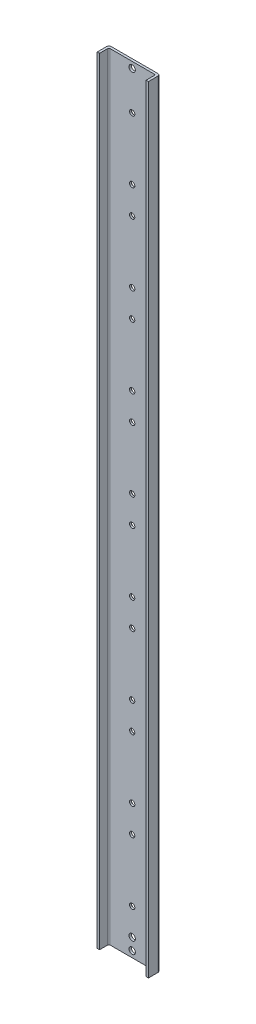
ISO-10303-21;
HEADER;
FILE_DESCRIPTION(('STEP AP214'),'2;1');
FILE_NAME('part.step','',(''),(''),'','','');
FILE_SCHEMA(('AUTOMOTIVE_DESIGN { 1 0 10303 214 1 1 1 1 }'));
ENDSEC;
DATA;
#1=APPLICATION_CONTEXT('core data for automotive mechanical design processes');
#2=APPLICATION_PROTOCOL_DEFINITION('international standard','automotive_design',2000,#1);
#3=PRODUCT_CONTEXT('',#1,'mechanical');
#4=PRODUCT('Part','Part','',(#3));
#5=PRODUCT_RELATED_PRODUCT_CATEGORY('part','',(#4));
#6=PRODUCT_DEFINITION_FORMATION('','',#4);
#7=PRODUCT_DEFINITION_CONTEXT('part definition',#1,'design');
#8=PRODUCT_DEFINITION('design','',#6,#7);
#9=PRODUCT_DEFINITION_SHAPE('','',#8);
#10=(LENGTH_UNIT() NAMED_UNIT(*) SI_UNIT(.MILLI.,.METRE.));
#11=(NAMED_UNIT(*) PLANE_ANGLE_UNIT() SI_UNIT($,.RADIAN.));
#12=(NAMED_UNIT(*) SI_UNIT($,.STERADIAN.) SOLID_ANGLE_UNIT());
#13=UNCERTAINTY_MEASURE_WITH_UNIT(LENGTH_MEASURE(1.E-05),#10,'distance_accuracy_value','');
#14=(GEOMETRIC_REPRESENTATION_CONTEXT(3) GLOBAL_UNCERTAINTY_ASSIGNED_CONTEXT((#13)) GLOBAL_UNIT_ASSIGNED_CONTEXT((#10,
#11,#12)) REPRESENTATION_CONTEXT('',''));
#15=CARTESIAN_POINT('',(0.,0.,0.));
#16=DIRECTION('',(0.,0.,1.));
#17=DIRECTION('',(1.,0.,0.));
#18=AXIS2_PLACEMENT_3D('',#15,#16,#17);
#19=CARTESIAN_POINT('',(-33.,500.,-7.5));
#20=DIRECTION('',(0.,0.,1.));
#21=DIRECTION('',(1.,0.,0.));
#22=AXIS2_PLACEMENT_3D('',#19,#20,#21);
#23=PLANE('',#22);
#24=CARTESIAN_POINT('',(0.,492.,-7.5));
#25=DIRECTION('',(0.,0.,-1.));
#26=DIRECTION('',(-1.,0.,0.));
#27=AXIS2_PLACEMENT_3D('',#24,#25,#26);
#28=CIRCLE('',#27,4.09999999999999);
#29=CARTESIAN_POINT('',(-4.09999999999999,492.,-7.5));
#30=VERTEX_POINT('',#29);
#31=EDGE_CURVE('E1046',#30,#30,#28,.T.);
#32=ORIENTED_EDGE('',*,*,#31,.F.);
#33=EDGE_LOOP('',(#32));
#34=FACE_BOUND('',#33,.T.);
#35=CARTESIAN_POINT('',(0.,-492.,-7.5));
#36=DIRECTION('',(0.,0.,-1.));
#37=DIRECTION('',(-1.,0.,0.));
#38=AXIS2_PLACEMENT_3D('',#35,#36,#37);
#39=CIRCLE('',#38,4.09999999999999);
#40=CARTESIAN_POINT('',(-4.09999999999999,-492.,-7.5));
#41=VERTEX_POINT('',#40);
#42=EDGE_CURVE('E215',#41,#41,#39,.T.);
#43=ORIENTED_EDGE('',*,*,#42,.F.);
#44=EDGE_LOOP('',(#43));
#45=FACE_BOUND('',#44,.T.);
#46=CARTESIAN_POINT('',(0.,-477.,-7.5));
#47=DIRECTION('',(0.,0.,-1.));
#48=DIRECTION('',(-1.,0.,0.));
#49=AXIS2_PLACEMENT_3D('',#46,#47,#48);
#50=CIRCLE('',#49,4.09999999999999);
#51=CARTESIAN_POINT('',(-4.09999999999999,-477.,-7.5));
#52=VERTEX_POINT('',#51);
#53=EDGE_CURVE('E229',#52,#52,#50,.T.);
#54=ORIENTED_EDGE('',*,*,#53,.F.);
#55=EDGE_LOOP('',(#54));
#56=FACE_BOUND('',#55,.T.);
#57=DIRECTION('',(-1.,0.,0.));
#58=VECTOR('',#57,1.);
#59=CARTESIAN_POINT('',(-33.,-500.,-7.5));
#60=LINE('',#59,#58);
#61=CARTESIAN_POINT('',(30.,-500.,-7.5));
#62=VERTEX_POINT('',#61);
#63=CARTESIAN_POINT('',(-30.,-500.,-7.5));
#64=VERTEX_POINT('',#63);
#65=EDGE_CURVE('E166',#62,#64,#60,.T.);
#66=ORIENTED_EDGE('',*,*,#65,.T.);
#67=DIRECTION('',(0.,-1.,0.));
#68=VECTOR('',#67,1.);
#69=CARTESIAN_POINT('',(-30.,500.,-7.5));
#70=LINE('',#69,#68);
#71=CARTESIAN_POINT('',(-30.,500.,-7.5));
#72=VERTEX_POINT('',#71);
#73=EDGE_CURVE('E190',#64,#72,#70,.F.);
#74=ORIENTED_EDGE('',*,*,#73,.T.);
#75=DIRECTION('',(-1.,0.,0.));
#76=VECTOR('',#75,1.);
#77=CARTESIAN_POINT('',(-33.,500.,-7.5));
#78=LINE('',#77,#76);
#79=CARTESIAN_POINT('',(30.,500.,-7.5));
#80=VERTEX_POINT('',#79);
#81=EDGE_CURVE('E159',#80,#72,#78,.T.);
#82=ORIENTED_EDGE('',*,*,#81,.F.);
#83=DIRECTION('',(0.,-1.,0.));
#84=VECTOR('',#83,1.);
#85=CARTESIAN_POINT('',(30.,500.,-7.5));
#86=LINE('',#85,#84);
#87=EDGE_CURVE('E187',#80,#62,#86,.T.);
#88=ORIENTED_EDGE('',*,*,#87,.T.);
#89=EDGE_LOOP('',(#66,#74,#82,#88));
#90=FACE_BOUND('',#89,.T.);
#91=CARTESIAN_POINT('',(0.,-442.5,-7.5));
#92=DIRECTION('',(0.,0.,-1.));
#93=DIRECTION('',(-1.,0.,0.));
#94=AXIS2_PLACEMENT_3D('',#91,#92,#93);
#95=CIRCLE('',#94,4.025);
#96=CARTESIAN_POINT('',(-4.025,-442.5,-7.5));
#97=VERTEX_POINT('',#96);
#98=EDGE_CURVE('E360',#97,#97,#95,.T.);
#99=ORIENTED_EDGE('',*,*,#98,.F.);
#100=EDGE_LOOP('',(#99));
#101=FACE_BOUND('',#100,.T.);
#102=CARTESIAN_POINT('',(0.,-362.5,-7.5));
#103=DIRECTION('',(0.,0.,-1.));
#104=DIRECTION('',(-1.,0.,0.));
#105=AXIS2_PLACEMENT_3D('',#102,#103,#104);
#106=CIRCLE('',#105,4.025);
#107=CARTESIAN_POINT('',(-4.025,-362.5,-7.5));
#108=VERTEX_POINT('',#107);
#109=EDGE_CURVE('E351',#108,#108,#106,.T.);
#110=ORIENTED_EDGE('',*,*,#109,.F.);
#111=EDGE_LOOP('',(#110));
#112=FACE_BOUND('',#111,.T.);
#113=CARTESIAN_POINT('',(0.,-327.5,-7.5));
#114=DIRECTION('',(0.,0.,-1.));
#115=DIRECTION('',(-1.,0.,0.));
#116=AXIS2_PLACEMENT_3D('',#113,#114,#115);
#117=CIRCLE('',#116,4.025);
#118=CARTESIAN_POINT('',(-4.025,-327.5,-7.5));
#119=VERTEX_POINT('',#118);
#120=EDGE_CURVE('E342',#119,#119,#117,.T.);
#121=ORIENTED_EDGE('',*,*,#120,.F.);
#122=EDGE_LOOP('',(#121));
#123=FACE_BOUND('',#122,.T.);
#124=CARTESIAN_POINT('',(0.,-247.5,-7.5));
#125=DIRECTION('',(0.,0.,-1.));
#126=DIRECTION('',(-1.,0.,0.));
#127=AXIS2_PLACEMENT_3D('',#124,#125,#126);
#128=CIRCLE('',#127,4.025);
#129=CARTESIAN_POINT('',(-4.025,-247.5,-7.5));
#130=VERTEX_POINT('',#129);
#131=EDGE_CURVE('E333',#130,#130,#128,.T.);
#132=ORIENTED_EDGE('',*,*,#131,.F.);
#133=EDGE_LOOP('',(#132));
#134=FACE_BOUND('',#133,.T.);
#135=CARTESIAN_POINT('',(0.,-212.5,-7.5));
#136=DIRECTION('',(0.,0.,-1.));
#137=DIRECTION('',(-1.,0.,0.));
#138=AXIS2_PLACEMENT_3D('',#135,#136,#137);
#139=CIRCLE('',#138,4.025);
#140=CARTESIAN_POINT('',(-4.025,-212.5,-7.5));
#141=VERTEX_POINT('',#140);
#142=EDGE_CURVE('E324',#141,#141,#139,.T.);
#143=ORIENTED_EDGE('',*,*,#142,.F.);
#144=EDGE_LOOP('',(#143));
#145=FACE_BOUND('',#144,.T.);
#146=CARTESIAN_POINT('',(0.,-132.5,-7.5));
#147=DIRECTION('',(0.,0.,-1.));
#148=DIRECTION('',(-1.,0.,0.));
#149=AXIS2_PLACEMENT_3D('',#146,#147,#148);
#150=CIRCLE('',#149,4.025);
#151=CARTESIAN_POINT('',(-4.025,-132.5,-7.5));
#152=VERTEX_POINT('',#151);
#153=EDGE_CURVE('E315',#152,#152,#150,.T.);
#154=ORIENTED_EDGE('',*,*,#153,.F.);
#155=EDGE_LOOP('',(#154));
#156=FACE_BOUND('',#155,.T.);
#157=CARTESIAN_POINT('',(0.,-97.5,-7.5));
#158=DIRECTION('',(0.,0.,-1.));
#159=DIRECTION('',(-1.,0.,0.));
#160=AXIS2_PLACEMENT_3D('',#157,#158,#159);
#161=CIRCLE('',#160,4.025);
#162=CARTESIAN_POINT('',(-4.025,-97.5,-7.5));
#163=VERTEX_POINT('',#162);
#164=EDGE_CURVE('E306',#163,#163,#161,.T.);
#165=ORIENTED_EDGE('',*,*,#164,.F.);
#166=EDGE_LOOP('',(#165));
#167=FACE_BOUND('',#166,.T.);
#168=CARTESIAN_POINT('',(0.,-17.5,-7.5));
#169=DIRECTION('',(0.,0.,-1.));
#170=DIRECTION('',(-1.,0.,0.));
#171=AXIS2_PLACEMENT_3D('',#168,#169,#170);
#172=CIRCLE('',#171,4.025);
#173=CARTESIAN_POINT('',(-4.025,-17.5,-7.5));
#174=VERTEX_POINT('',#173);
#175=EDGE_CURVE('E297',#174,#174,#172,.T.);
#176=ORIENTED_EDGE('',*,*,#175,.F.);
#177=EDGE_LOOP('',(#176));
#178=FACE_BOUND('',#177,.T.);
#179=CARTESIAN_POINT('',(0.,17.5,-7.5));
#180=DIRECTION('',(0.,0.,-1.));
#181=DIRECTION('',(-1.,0.,0.));
#182=AXIS2_PLACEMENT_3D('',#179,#180,#181);
#183=CIRCLE('',#182,4.025);
#184=CARTESIAN_POINT('',(-4.025,17.5,-7.5));
#185=VERTEX_POINT('',#184);
#186=EDGE_CURVE('E288',#185,#185,#183,.T.);
#187=ORIENTED_EDGE('',*,*,#186,.F.);
#188=EDGE_LOOP('',(#187));
#189=FACE_BOUND('',#188,.T.);
#190=CARTESIAN_POINT('',(0.,97.5,-7.5));
#191=DIRECTION('',(0.,0.,-1.));
#192=DIRECTION('',(-1.,0.,0.));
#193=AXIS2_PLACEMENT_3D('',#190,#191,#192);
#194=CIRCLE('',#193,4.025);
#195=CARTESIAN_POINT('',(-4.025,97.5,-7.5));
#196=VERTEX_POINT('',#195);
#197=EDGE_CURVE('E279',#196,#196,#194,.T.);
#198=ORIENTED_EDGE('',*,*,#197,.F.);
#199=EDGE_LOOP('',(#198));
#200=FACE_BOUND('',#199,.T.);
#201=CARTESIAN_POINT('',(0.,132.5,-7.5));
#202=DIRECTION('',(0.,0.,-1.));
#203=DIRECTION('',(-1.,0.,0.));
#204=AXIS2_PLACEMENT_3D('',#201,#202,#203);
#205=CIRCLE('',#204,4.025);
#206=CARTESIAN_POINT('',(-4.025,132.5,-7.5));
#207=VERTEX_POINT('',#206);
#208=EDGE_CURVE('E270',#207,#207,#205,.T.);
#209=ORIENTED_EDGE('',*,*,#208,.F.);
#210=EDGE_LOOP('',(#209));
#211=FACE_BOUND('',#210,.T.);
#212=CARTESIAN_POINT('',(0.,212.5,-7.5));
#213=DIRECTION('',(0.,0.,-1.));
#214=DIRECTION('',(-1.,0.,0.));
#215=AXIS2_PLACEMENT_3D('',#212,#213,#214);
#216=CIRCLE('',#215,4.025);
#217=CARTESIAN_POINT('',(-4.025,212.5,-7.5));
#218=VERTEX_POINT('',#217);
#219=EDGE_CURVE('E261',#218,#218,#216,.T.);
#220=ORIENTED_EDGE('',*,*,#219,.F.);
#221=EDGE_LOOP('',(#220));
#222=FACE_BOUND('',#221,.T.);
#223=CARTESIAN_POINT('',(0.,247.5,-7.5));
#224=DIRECTION('',(0.,0.,-1.));
#225=DIRECTION('',(-1.,0.,0.));
#226=AXIS2_PLACEMENT_3D('',#223,#224,#225);
#227=CIRCLE('',#226,4.025);
#228=CARTESIAN_POINT('',(-4.025,247.5,-7.5));
#229=VERTEX_POINT('',#228);
#230=EDGE_CURVE('E252',#229,#229,#227,.T.);
#231=ORIENTED_EDGE('',*,*,#230,.F.);
#232=EDGE_LOOP('',(#231));
#233=FACE_BOUND('',#232,.T.);
#234=CARTESIAN_POINT('',(0.,327.5,-7.5));
#235=DIRECTION('',(0.,0.,-1.));
#236=DIRECTION('',(-1.,0.,0.));
#237=AXIS2_PLACEMENT_3D('',#234,#235,#236);
#238=CIRCLE('',#237,4.025);
#239=CARTESIAN_POINT('',(-4.025,327.5,-7.5));
#240=VERTEX_POINT('',#239);
#241=EDGE_CURVE('E243',#240,#240,#238,.T.);
#242=ORIENTED_EDGE('',*,*,#241,.F.);
#243=EDGE_LOOP('',(#242));
#244=FACE_BOUND('',#243,.T.);
#245=CARTESIAN_POINT('',(0.,362.5,-7.5));
#246=DIRECTION('',(0.,0.,-1.));
#247=DIRECTION('',(-1.,0.,0.));
#248=AXIS2_PLACEMENT_3D('',#245,#246,#247);
#249=CIRCLE('',#248,4.025);
#250=CARTESIAN_POINT('',(-4.025,362.5,-7.5));
#251=VERTEX_POINT('',#250);
#252=EDGE_CURVE('E234',#251,#251,#249,.T.);
#253=ORIENTED_EDGE('',*,*,#252,.F.);
#254=EDGE_LOOP('',(#253));
#255=FACE_BOUND('',#254,.T.);
#256=CARTESIAN_POINT('',(0.,442.5,-7.5));
#257=DIRECTION('',(0.,0.,-1.));
#258=DIRECTION('',(-1.,0.,0.));
#259=AXIS2_PLACEMENT_3D('',#256,#257,#258);
#260=CIRCLE('',#259,4.025);
#261=CARTESIAN_POINT('',(-4.025,442.5,-7.5));
#262=VERTEX_POINT('',#261);
#263=EDGE_CURVE('E217',#262,#262,#260,.T.);
#264=ORIENTED_EDGE('',*,*,#263,.F.);
#265=EDGE_LOOP('',(#264));
#266=FACE_BOUND('',#265,.T.);
#267=ADVANCED_FACE('F44',(#34,#45,#56,#90,#101,#112,#123,#134,#145,#156,#167,#178,#189,#200,
#211,#222,#233,#244,#255,#266),#23,.F.);
#268=CARTESIAN_POINT('',(-33.,500.,7.5));
#269=DIRECTION('',(0.,0.,-1.));
#270=DIRECTION('',(-1.,0.,0.));
#271=AXIS2_PLACEMENT_3D('',#268,#269,#270);
#272=PLANE('',#271);
#273=DIRECTION('',(1.,0.,0.));
#274=VECTOR('',#273,1.);
#275=CARTESIAN_POINT('',(-33.,-500.,7.5));
#276=LINE('',#275,#274);
#277=CARTESIAN_POINT('',(-33.,-500.,7.5));
#278=VERTEX_POINT('',#277);
#279=CARTESIAN_POINT('',(-30.,-500.,7.5));
#280=VERTEX_POINT('',#279);
#281=EDGE_CURVE('E172',#278,#280,#276,.T.);
#282=ORIENTED_EDGE('',*,*,#281,.T.);
#283=DIRECTION('',(0.,-1.,0.));
#284=VECTOR('',#283,1.);
#285=CARTESIAN_POINT('',(-30.,500.,7.5));
#286=LINE('',#285,#284);
#287=CARTESIAN_POINT('',(-30.,500.,7.5));
#288=VERTEX_POINT('',#287);
#289=EDGE_CURVE('E149',#288,#280,#286,.T.);
#290=ORIENTED_EDGE('',*,*,#289,.F.);
#291=DIRECTION('',(1.,0.,0.));
#292=VECTOR('',#291,1.);
#293=CARTESIAN_POINT('',(-33.,500.,7.5));
#294=LINE('',#293,#292);
#295=CARTESIAN_POINT('',(-33.,500.,7.5));
#296=VERTEX_POINT('',#295);
#297=EDGE_CURVE('E155',#296,#288,#294,.T.);
#298=ORIENTED_EDGE('',*,*,#297,.F.);
#299=DIRECTION('',(0.,-1.,0.));
#300=VECTOR('',#299,1.);
#301=CARTESIAN_POINT('',(-33.,500.,7.5));
#302=LINE('',#301,#300);
#303=EDGE_CURVE('E177',#296,#278,#302,.T.);
#304=ORIENTED_EDGE('',*,*,#303,.T.);
#305=EDGE_LOOP('',(#282,#290,#298,#304));
#306=FACE_BOUND('',#305,.T.);
#307=ADVANCED_FACE('F402',(#306),#272,.F.);
#308=CARTESIAN_POINT('',(33.,500.,7.5));
#309=DIRECTION('',(-1.,0.,0.));
#310=DIRECTION('',(0.,0.,1.));
#311=AXIS2_PLACEMENT_3D('',#308,#309,#310);
#312=PLANE('',#311);
#313=DIRECTION('',(0.,0.,-1.));
#314=VECTOR('',#313,1.);
#315=CARTESIAN_POINT('',(33.,-500.,7.5));
#316=LINE('',#315,#314);
#317=CARTESIAN_POINT('',(33.,-500.,7.5));
#318=VERTEX_POINT('',#317);
#319=CARTESIAN_POINT('',(33.,-500.,-4.5));
#320=VERTEX_POINT('',#319);
#321=EDGE_CURVE('E163',#318,#320,#316,.T.);
#322=ORIENTED_EDGE('',*,*,#321,.T.);
#323=DIRECTION('',(0.,-1.,0.));
#324=VECTOR('',#323,1.);
#325=CARTESIAN_POINT('',(33.,500.,-4.5));
#326=LINE('',#325,#324);
#327=CARTESIAN_POINT('',(33.,500.,-4.5));
#328=VERTEX_POINT('',#327);
#329=EDGE_CURVE('E196',#320,#328,#326,.F.);
#330=ORIENTED_EDGE('',*,*,#329,.T.);
#331=DIRECTION('',(0.,0.,-1.));
#332=VECTOR('',#331,1.);
#333=CARTESIAN_POINT('',(33.,500.,7.5));
#334=LINE('',#333,#332);
#335=CARTESIAN_POINT('',(33.,500.,7.5));
#336=VERTEX_POINT('',#335);
#337=EDGE_CURVE('E175',#336,#328,#334,.T.);
#338=ORIENTED_EDGE('',*,*,#337,.F.);
#339=DIRECTION('',(0.,-1.,0.));
#340=VECTOR('',#339,1.);
#341=CARTESIAN_POINT('',(33.,500.,7.5));
#342=LINE('',#341,#340);
#343=EDGE_CURVE('E153',#336,#318,#342,.T.);
#344=ORIENTED_EDGE('',*,*,#343,.T.);
#345=EDGE_LOOP('',(#322,#330,#338,#344));
#346=FACE_BOUND('',#345,.T.);
#347=ADVANCED_FACE('F416',(#346),#312,.F.);
#348=CARTESIAN_POINT('',(-33.,500.,7.5));
#349=DIRECTION('',(1.,0.,0.));
#350=DIRECTION('',(0.,0.,-1.));
#351=AXIS2_PLACEMENT_3D('',#348,#349,#350);
#352=PLANE('',#351);
#353=DIRECTION('',(0.,0.,1.));
#354=VECTOR('',#353,1.);
#355=CARTESIAN_POINT('',(-33.,500.,7.5));
#356=LINE('',#355,#354);
#357=CARTESIAN_POINT('',(-33.,500.,-4.5));
#358=VERTEX_POINT('',#357);
#359=EDGE_CURVE('E156',#358,#296,#356,.T.);
#360=ORIENTED_EDGE('',*,*,#359,.F.);
#361=DIRECTION('',(0.,-1.,0.));
#362=VECTOR('',#361,1.);
#363=CARTESIAN_POINT('',(-33.,500.,-4.5));
#364=LINE('',#363,#362);
#365=CARTESIAN_POINT('',(-33.,-500.,-4.5));
#366=VERTEX_POINT('',#365);
#367=EDGE_CURVE('E180',#358,#366,#364,.T.);
#368=ORIENTED_EDGE('',*,*,#367,.T.);
#369=DIRECTION('',(0.,0.,1.));
#370=VECTOR('',#369,1.);
#371=CARTESIAN_POINT('',(-33.,-500.,7.5));
#372=LINE('',#371,#370);
#373=EDGE_CURVE('E169',#366,#278,#372,.T.);
#374=ORIENTED_EDGE('',*,*,#373,.T.);
#375=ORIENTED_EDGE('',*,*,#303,.F.);
#376=EDGE_LOOP('',(#360,#368,#374,#375));
#377=FACE_BOUND('',#376,.T.);
#378=ADVANCED_FACE('F393',(#377),#352,.F.);
#379=CARTESIAN_POINT('',(30.,500.,7.5));
#380=VERTEX_POINT('',#379);
#381=EDGE_CURVE('E137',#380,#336,#294,.T.);
#382=ORIENTED_EDGE('',*,*,#381,.F.);
#383=DIRECTION('',(0.,-1.,0.));
#384=VECTOR('',#383,1.);
#385=CARTESIAN_POINT('',(30.,500.,7.5));
#386=LINE('',#385,#384);
#387=CARTESIAN_POINT('',(30.,-500.,7.5));
#388=VERTEX_POINT('',#387);
#389=EDGE_CURVE('E140',#380,#388,#386,.T.);
#390=ORIENTED_EDGE('',*,*,#389,.T.);
#391=EDGE_CURVE('E171',#388,#318,#276,.T.);
#392=ORIENTED_EDGE('',*,*,#391,.T.);
#393=ORIENTED_EDGE('',*,*,#343,.F.);
#394=EDGE_LOOP('',(#382,#390,#392,#393));
#395=FACE_BOUND('',#394,.T.);
#396=ADVANCED_FACE('F151',(#395),#272,.F.);
#397=CARTESIAN_POINT('',(0.,500.,0.));
#398=DIRECTION('',(0.,-1.,0.));
#399=DIRECTION('',(0.,0.,-1.));
#400=AXIS2_PLACEMENT_3D('',#397,#398,#399);
#401=PLANE('',#400);
#402=ORIENTED_EDGE('',*,*,#81,.T.);
#403=CARTESIAN_POINT('',(-30.,500.,-4.5));
#404=DIRECTION('',(0.,-1.,0.));
#405=DIRECTION('',(0.,0.,-1.));
#406=AXIS2_PLACEMENT_3D('',#403,#404,#405);
#407=CIRCLE('',#406,3.);
#408=EDGE_CURVE('E194',#72,#358,#407,.F.);
#409=ORIENTED_EDGE('',*,*,#408,.T.);
#410=ORIENTED_EDGE('',*,*,#359,.T.);
#411=ORIENTED_EDGE('',*,*,#297,.T.);
#412=DIRECTION('',(0.,0.,-1.));
#413=VECTOR('',#412,1.);
#414=CARTESIAN_POINT('',(-30.,500.,-4.50000000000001));
#415=LINE('',#414,#413);
#416=CARTESIAN_POINT('',(-30.,500.,-3.00000000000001));
#417=VERTEX_POINT('',#416);
#418=EDGE_CURVE('E370',#288,#417,#415,.T.);
#419=ORIENTED_EDGE('',*,*,#418,.T.);
#420=CARTESIAN_POINT('',(-28.5,500.,-3.00000000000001));
#421=DIRECTION('',(0.,-1.,0.));
#422=DIRECTION('',(0.,0.,-1.));
#423=AXIS2_PLACEMENT_3D('',#420,#421,#422);
#424=CIRCLE('',#423,1.5);
#425=CARTESIAN_POINT('',(-28.5,500.,-4.50000000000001));
#426=VERTEX_POINT('',#425);
#427=EDGE_CURVE('E209',#417,#426,#424,.T.);
#428=ORIENTED_EDGE('',*,*,#427,.T.);
#429=DIRECTION('',(1.,0.,0.));
#430=VECTOR('',#429,1.);
#431=CARTESIAN_POINT('',(30.,500.,-4.5));
#432=LINE('',#431,#430);
#433=CARTESIAN_POINT('',(28.5,500.,-4.5));
#434=VERTEX_POINT('',#433);
#435=EDGE_CURVE('E141',#426,#434,#432,.T.);
#436=ORIENTED_EDGE('',*,*,#435,.T.);
#437=CARTESIAN_POINT('',(28.5,500.,-3.));
#438=DIRECTION('',(0.,-1.,0.));
#439=DIRECTION('',(0.,0.,-1.));
#440=AXIS2_PLACEMENT_3D('',#437,#438,#439);
#441=CIRCLE('',#440,1.5);
#442=CARTESIAN_POINT('',(30.,500.,-3.));
#443=VERTEX_POINT('',#442);
#444=EDGE_CURVE('E11',#434,#443,#441,.T.);
#445=ORIENTED_EDGE('',*,*,#444,.T.);
#446=DIRECTION('',(0.,0.,1.));
#447=VECTOR('',#446,1.);
#448=CARTESIAN_POINT('',(30.,500.,7.5));
#449=LINE('',#448,#447);
#450=EDGE_CURVE('E131',#443,#380,#449,.T.);
#451=ORIENTED_EDGE('',*,*,#450,.T.);
#452=ORIENTED_EDGE('',*,*,#381,.T.);
#453=ORIENTED_EDGE('',*,*,#337,.T.);
#454=CARTESIAN_POINT('',(30.,500.,-4.5));
#455=DIRECTION('',(0.,-1.,0.));
#456=DIRECTION('',(0.,0.,-1.));
#457=AXIS2_PLACEMENT_3D('',#454,#455,#456);
#458=CIRCLE('',#457,3.);
#459=EDGE_CURVE('E192',#328,#80,#458,.F.);
#460=ORIENTED_EDGE('',*,*,#459,.T.);
#461=EDGE_LOOP('',(#402,#409,#410,#411,#419,#428,#436,#445,#451,#452,#453,#460));
#462=FACE_BOUND('',#461,.T.);
#463=ADVANCED_FACE('F134',(#462),#401,.F.);
#464=CARTESIAN_POINT('',(0.,-500.,0.));
#465=DIRECTION('',(0.,-1.,0.));
#466=DIRECTION('',(0.,0.,-1.));
#467=AXIS2_PLACEMENT_3D('',#464,#465,#466);
#468=PLANE('',#467);
#469=ORIENTED_EDGE('',*,*,#373,.F.);
#470=CARTESIAN_POINT('',(-30.,-500.,-4.5));
#471=DIRECTION('',(0.,-1.,0.));
#472=DIRECTION('',(0.,0.,-1.));
#473=AXIS2_PLACEMENT_3D('',#470,#471,#472);
#474=CIRCLE('',#473,3.);
#475=EDGE_CURVE('E185',#366,#64,#474,.T.);
#476=ORIENTED_EDGE('',*,*,#475,.T.);
#477=ORIENTED_EDGE('',*,*,#65,.F.);
#478=CARTESIAN_POINT('',(30.,-500.,-4.5));
#479=DIRECTION('',(0.,-1.,0.));
#480=DIRECTION('',(0.,0.,-1.));
#481=AXIS2_PLACEMENT_3D('',#478,#479,#480);
#482=CIRCLE('',#481,3.);
#483=EDGE_CURVE('E183',#62,#320,#482,.T.);
#484=ORIENTED_EDGE('',*,*,#483,.T.);
#485=ORIENTED_EDGE('',*,*,#321,.F.);
#486=ORIENTED_EDGE('',*,*,#391,.F.);
#487=DIRECTION('',(0.,0.,1.));
#488=VECTOR('',#487,1.);
#489=CARTESIAN_POINT('',(30.,-500.,7.5));
#490=LINE('',#489,#488);
#491=CARTESIAN_POINT('',(30.,-500.,-3.));
#492=VERTEX_POINT('',#491);
#493=EDGE_CURVE('E146',#492,#388,#490,.T.);
#494=ORIENTED_EDGE('',*,*,#493,.F.);
#495=CARTESIAN_POINT('',(28.5,-500.,-3.));
#496=DIRECTION('',(0.,-1.,0.));
#497=DIRECTION('',(0.,0.,-1.));
#498=AXIS2_PLACEMENT_3D('',#495,#496,#497);
#499=CIRCLE('',#498,1.5);
#500=CARTESIAN_POINT('',(28.5,-500.,-4.5));
#501=VERTEX_POINT('',#500);
#502=EDGE_CURVE('E53',#492,#501,#499,.F.);
#503=ORIENTED_EDGE('',*,*,#502,.T.);
#504=DIRECTION('',(1.,0.,0.));
#505=VECTOR('',#504,1.);
#506=CARTESIAN_POINT('',(30.,-500.,-4.5));
#507=LINE('',#506,#505);
#508=CARTESIAN_POINT('',(-28.5,-500.,-4.50000000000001));
#509=VERTEX_POINT('',#508);
#510=EDGE_CURVE('E376',#509,#501,#507,.T.);
#511=ORIENTED_EDGE('',*,*,#510,.F.);
#512=CARTESIAN_POINT('',(-28.5,-500.,-3.00000000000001));
#513=DIRECTION('',(0.,-1.,0.));
#514=DIRECTION('',(0.,0.,-1.));
#515=AXIS2_PLACEMENT_3D('',#512,#513,#514);
#516=CIRCLE('',#515,1.5);
#517=CARTESIAN_POINT('',(-30.,-500.,-3.00000000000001));
#518=VERTEX_POINT('',#517);
#519=EDGE_CURVE('E207',#509,#518,#516,.F.);
#520=ORIENTED_EDGE('',*,*,#519,.T.);
#521=DIRECTION('',(0.,0.,-1.));
#522=VECTOR('',#521,1.);
#523=CARTESIAN_POINT('',(-30.,-500.,-4.50000000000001));
#524=LINE('',#523,#522);
#525=EDGE_CURVE('E369',#280,#518,#524,.T.);
#526=ORIENTED_EDGE('',*,*,#525,.F.);
#527=ORIENTED_EDGE('',*,*,#281,.F.);
#528=EDGE_LOOP('',(#469,#476,#477,#484,#485,#486,#494,#503,#511,#520,#526,#527));
#529=FACE_BOUND('',#528,.T.);
#530=ADVANCED_FACE('F397',(#529),#468,.T.);
#531=CARTESIAN_POINT('',(-30.,500.,-4.50000000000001));
#532=DIRECTION('',(-1.,0.,0.));
#533=DIRECTION('',(0.,0.,1.));
#534=AXIS2_PLACEMENT_3D('',#531,#532,#533);
#535=PLANE('',#534);
#536=ORIENTED_EDGE('',*,*,#525,.T.);
#537=DIRECTION('',(0.,-1.,0.));
#538=VECTOR('',#537,1.);
#539=CARTESIAN_POINT('',(-30.,500.,-3.00000000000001));
#540=LINE('',#539,#538);
#541=EDGE_CURVE('E203',#518,#417,#540,.F.);
#542=ORIENTED_EDGE('',*,*,#541,.T.);
#543=ORIENTED_EDGE('',*,*,#418,.F.);
#544=ORIENTED_EDGE('',*,*,#289,.T.);
#545=EDGE_LOOP('',(#536,#542,#543,#544));
#546=FACE_BOUND('',#545,.T.);
#547=ADVANCED_FACE('F587',(#546),#535,.F.);
#548=CARTESIAN_POINT('',(30.,500.,7.5));
#549=DIRECTION('',(1.,0.,0.));
#550=DIRECTION('',(0.,0.,-1.));
#551=AXIS2_PLACEMENT_3D('',#548,#549,#550);
#552=PLANE('',#551);
#553=ORIENTED_EDGE('',*,*,#450,.F.);
#554=DIRECTION('',(0.,-1.,0.));
#555=VECTOR('',#554,1.);
#556=CARTESIAN_POINT('',(30.,-500.,-3.));
#557=LINE('',#556,#555);
#558=EDGE_CURVE('E205',#443,#492,#557,.T.);
#559=ORIENTED_EDGE('',*,*,#558,.T.);
#560=ORIENTED_EDGE('',*,*,#493,.T.);
#561=ORIENTED_EDGE('',*,*,#389,.F.);
#562=EDGE_LOOP('',(#553,#559,#560,#561));
#563=FACE_BOUND('',#562,.T.);
#564=ADVANCED_FACE('F144',(#563),#552,.F.);
#565=CARTESIAN_POINT('',(30.,500.,-4.5));
#566=DIRECTION('',(0.,0.,-1.));
#567=DIRECTION('',(-1.,0.,0.));
#568=AXIS2_PLACEMENT_3D('',#565,#566,#567);
#569=PLANE('',#568);
#570=CARTESIAN_POINT('',(0.,492.,-4.5));
#571=DIRECTION('',(0.,0.,-1.));
#572=DIRECTION('',(-1.,0.,0.));
#573=AXIS2_PLACEMENT_3D('',#570,#571,#572);
#574=CIRCLE('',#573,4.09999999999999);
#575=CARTESIAN_POINT('',(-4.09999999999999,492.,-4.5));
#576=VERTEX_POINT('',#575);
#577=EDGE_CURVE('E48',#576,#576,#574,.T.);
#578=ORIENTED_EDGE('',*,*,#577,.T.);
#579=EDGE_LOOP('',(#578));
#580=FACE_BOUND('',#579,.T.);
#581=CARTESIAN_POINT('',(0.,-492.,-4.5));
#582=DIRECTION('',(0.,0.,-1.));
#583=DIRECTION('',(-1.,0.,0.));
#584=AXIS2_PLACEMENT_3D('',#581,#582,#583);
#585=CIRCLE('',#584,4.09999999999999);
#586=CARTESIAN_POINT('',(-4.09999999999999,-492.,-4.5));
#587=VERTEX_POINT('',#586);
#588=EDGE_CURVE('E214',#587,#587,#585,.T.);
#589=ORIENTED_EDGE('',*,*,#588,.T.);
#590=EDGE_LOOP('',(#589));
#591=FACE_BOUND('',#590,.T.);
#592=CARTESIAN_POINT('',(0.,-477.,-4.5));
#593=DIRECTION('',(0.,0.,-1.));
#594=DIRECTION('',(-1.,0.,0.));
#595=AXIS2_PLACEMENT_3D('',#592,#593,#594);
#596=CIRCLE('',#595,4.09999999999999);
#597=CARTESIAN_POINT('',(-4.09999999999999,-477.,-4.5));
#598=VERTEX_POINT('',#597);
#599=EDGE_CURVE('E212',#598,#598,#596,.T.);
#600=ORIENTED_EDGE('',*,*,#599,.T.);
#601=EDGE_LOOP('',(#600));
#602=FACE_BOUND('',#601,.T.);
#603=CARTESIAN_POINT('',(0.,442.5,-4.5));
#604=DIRECTION('',(0.,0.,-1.));
#605=DIRECTION('',(-1.,0.,0.));
#606=AXIS2_PLACEMENT_3D('',#603,#604,#605);
#607=CIRCLE('',#606,3.4);
#608=CARTESIAN_POINT('',(-3.4,442.5,-4.5));
#609=VERTEX_POINT('',#608);
#610=EDGE_CURVE('E226',#609,#609,#607,.T.);
#611=ORIENTED_EDGE('',*,*,#610,.T.);
#612=EDGE_LOOP('',(#611));
#613=FACE_BOUND('',#612,.T.);
#614=CARTESIAN_POINT('',(0.,362.5,-4.5));
#615=DIRECTION('',(0.,0.,-1.));
#616=DIRECTION('',(-1.,0.,0.));
#617=AXIS2_PLACEMENT_3D('',#614,#615,#616);
#618=CIRCLE('',#617,3.4);
#619=CARTESIAN_POINT('',(-3.4,362.5,-4.5));
#620=VERTEX_POINT('',#619);
#621=EDGE_CURVE('E240',#620,#620,#618,.T.);
#622=ORIENTED_EDGE('',*,*,#621,.T.);
#623=EDGE_LOOP('',(#622));
#624=FACE_BOUND('',#623,.T.);
#625=CARTESIAN_POINT('',(0.,327.5,-4.5));
#626=DIRECTION('',(0.,0.,-1.));
#627=DIRECTION('',(-1.,0.,0.));
#628=AXIS2_PLACEMENT_3D('',#625,#626,#627);
#629=CIRCLE('',#628,3.4);
#630=CARTESIAN_POINT('',(-3.4,327.5,-4.5));
#631=VERTEX_POINT('',#630);
#632=EDGE_CURVE('E249',#631,#631,#629,.T.);
#633=ORIENTED_EDGE('',*,*,#632,.T.);
#634=EDGE_LOOP('',(#633));
#635=FACE_BOUND('',#634,.T.);
#636=CARTESIAN_POINT('',(0.,247.5,-4.5));
#637=DIRECTION('',(0.,0.,-1.));
#638=DIRECTION('',(-1.,0.,0.));
#639=AXIS2_PLACEMENT_3D('',#636,#637,#638);
#640=CIRCLE('',#639,3.4);
#641=CARTESIAN_POINT('',(-3.4,247.5,-4.5));
#642=VERTEX_POINT('',#641);
#643=EDGE_CURVE('E258',#642,#642,#640,.T.);
#644=ORIENTED_EDGE('',*,*,#643,.T.);
#645=EDGE_LOOP('',(#644));
#646=FACE_BOUND('',#645,.T.);
#647=CARTESIAN_POINT('',(0.,212.5,-4.5));
#648=DIRECTION('',(0.,0.,-1.));
#649=DIRECTION('',(-1.,0.,0.));
#650=AXIS2_PLACEMENT_3D('',#647,#648,#649);
#651=CIRCLE('',#650,3.4);
#652=CARTESIAN_POINT('',(-3.4,212.5,-4.5));
#653=VERTEX_POINT('',#652);
#654=EDGE_CURVE('E267',#653,#653,#651,.T.);
#655=ORIENTED_EDGE('',*,*,#654,.T.);
#656=EDGE_LOOP('',(#655));
#657=FACE_BOUND('',#656,.T.);
#658=CARTESIAN_POINT('',(0.,132.5,-4.5));
#659=DIRECTION('',(0.,0.,-1.));
#660=DIRECTION('',(-1.,0.,0.));
#661=AXIS2_PLACEMENT_3D('',#658,#659,#660);
#662=CIRCLE('',#661,3.4);
#663=CARTESIAN_POINT('',(-3.4,132.5,-4.5));
#664=VERTEX_POINT('',#663);
#665=EDGE_CURVE('E276',#664,#664,#662,.T.);
#666=ORIENTED_EDGE('',*,*,#665,.T.);
#667=EDGE_LOOP('',(#666));
#668=FACE_BOUND('',#667,.T.);
#669=CARTESIAN_POINT('',(0.,97.5,-4.5));
#670=DIRECTION('',(0.,0.,-1.));
#671=DIRECTION('',(-1.,0.,0.));
#672=AXIS2_PLACEMENT_3D('',#669,#670,#671);
#673=CIRCLE('',#672,3.4);
#674=CARTESIAN_POINT('',(-3.4,97.5,-4.5));
#675=VERTEX_POINT('',#674);
#676=EDGE_CURVE('E285',#675,#675,#673,.T.);
#677=ORIENTED_EDGE('',*,*,#676,.T.);
#678=EDGE_LOOP('',(#677));
#679=FACE_BOUND('',#678,.T.);
#680=CARTESIAN_POINT('',(0.,17.5,-4.5));
#681=DIRECTION('',(0.,0.,-1.));
#682=DIRECTION('',(-1.,0.,0.));
#683=AXIS2_PLACEMENT_3D('',#680,#681,#682);
#684=CIRCLE('',#683,3.4);
#685=CARTESIAN_POINT('',(-3.4,17.5,-4.5));
#686=VERTEX_POINT('',#685);
#687=EDGE_CURVE('E294',#686,#686,#684,.T.);
#688=ORIENTED_EDGE('',*,*,#687,.T.);
#689=EDGE_LOOP('',(#688));
#690=FACE_BOUND('',#689,.T.);
#691=CARTESIAN_POINT('',(0.,-17.5,-4.5));
#692=DIRECTION('',(0.,0.,-1.));
#693=DIRECTION('',(-1.,0.,0.));
#694=AXIS2_PLACEMENT_3D('',#691,#692,#693);
#695=CIRCLE('',#694,3.4);
#696=CARTESIAN_POINT('',(-3.4,-17.5,-4.5));
#697=VERTEX_POINT('',#696);
#698=EDGE_CURVE('E303',#697,#697,#695,.T.);
#699=ORIENTED_EDGE('',*,*,#698,.T.);
#700=EDGE_LOOP('',(#699));
#701=FACE_BOUND('',#700,.T.);
#702=CARTESIAN_POINT('',(0.,-97.5,-4.5));
#703=DIRECTION('',(0.,0.,-1.));
#704=DIRECTION('',(-1.,0.,0.));
#705=AXIS2_PLACEMENT_3D('',#702,#703,#704);
#706=CIRCLE('',#705,3.4);
#707=CARTESIAN_POINT('',(-3.4,-97.5,-4.5));
#708=VERTEX_POINT('',#707);
#709=EDGE_CURVE('E312',#708,#708,#706,.T.);
#710=ORIENTED_EDGE('',*,*,#709,.T.);
#711=EDGE_LOOP('',(#710));
#712=FACE_BOUND('',#711,.T.);
#713=CARTESIAN_POINT('',(0.,-132.5,-4.5));
#714=DIRECTION('',(0.,0.,-1.));
#715=DIRECTION('',(-1.,0.,0.));
#716=AXIS2_PLACEMENT_3D('',#713,#714,#715);
#717=CIRCLE('',#716,3.4);
#718=CARTESIAN_POINT('',(-3.4,-132.5,-4.5));
#719=VERTEX_POINT('',#718);
#720=EDGE_CURVE('E321',#719,#719,#717,.T.);
#721=ORIENTED_EDGE('',*,*,#720,.T.);
#722=EDGE_LOOP('',(#721));
#723=FACE_BOUND('',#722,.T.);
#724=CARTESIAN_POINT('',(0.,-212.5,-4.5));
#725=DIRECTION('',(0.,0.,-1.));
#726=DIRECTION('',(-1.,0.,0.));
#727=AXIS2_PLACEMENT_3D('',#724,#725,#726);
#728=CIRCLE('',#727,3.4);
#729=CARTESIAN_POINT('',(-3.4,-212.5,-4.5));
#730=VERTEX_POINT('',#729);
#731=EDGE_CURVE('E330',#730,#730,#728,.T.);
#732=ORIENTED_EDGE('',*,*,#731,.T.);
#733=EDGE_LOOP('',(#732));
#734=FACE_BOUND('',#733,.T.);
#735=CARTESIAN_POINT('',(0.,-247.5,-4.5));
#736=DIRECTION('',(0.,0.,-1.));
#737=DIRECTION('',(-1.,0.,0.));
#738=AXIS2_PLACEMENT_3D('',#735,#736,#737);
#739=CIRCLE('',#738,3.4);
#740=CARTESIAN_POINT('',(-3.4,-247.5,-4.5));
#741=VERTEX_POINT('',#740);
#742=EDGE_CURVE('E339',#741,#741,#739,.T.);
#743=ORIENTED_EDGE('',*,*,#742,.T.);
#744=EDGE_LOOP('',(#743));
#745=FACE_BOUND('',#744,.T.);
#746=CARTESIAN_POINT('',(0.,-327.5,-4.5));
#747=DIRECTION('',(0.,0.,-1.));
#748=DIRECTION('',(-1.,0.,0.));
#749=AXIS2_PLACEMENT_3D('',#746,#747,#748);
#750=CIRCLE('',#749,3.4);
#751=CARTESIAN_POINT('',(-3.4,-327.5,-4.5));
#752=VERTEX_POINT('',#751);
#753=EDGE_CURVE('E348',#752,#752,#750,.T.);
#754=ORIENTED_EDGE('',*,*,#753,.T.);
#755=EDGE_LOOP('',(#754));
#756=FACE_BOUND('',#755,.T.);
#757=CARTESIAN_POINT('',(0.,-362.5,-4.5));
#758=DIRECTION('',(0.,0.,-1.));
#759=DIRECTION('',(-1.,0.,0.));
#760=AXIS2_PLACEMENT_3D('',#757,#758,#759);
#761=CIRCLE('',#760,3.4);
#762=CARTESIAN_POINT('',(-3.4,-362.5,-4.5));
#763=VERTEX_POINT('',#762);
#764=EDGE_CURVE('E357',#763,#763,#761,.T.);
#765=ORIENTED_EDGE('',*,*,#764,.T.);
#766=EDGE_LOOP('',(#765));
#767=FACE_BOUND('',#766,.T.);
#768=CARTESIAN_POINT('',(0.,-442.5,-4.5));
#769=DIRECTION('',(0.,0.,-1.));
#770=DIRECTION('',(-1.,0.,0.));
#771=AXIS2_PLACEMENT_3D('',#768,#769,#770);
#772=CIRCLE('',#771,3.4);
#773=CARTESIAN_POINT('',(-3.4,-442.5,-4.5));
#774=VERTEX_POINT('',#773);
#775=EDGE_CURVE('E366',#774,#774,#772,.T.);
#776=ORIENTED_EDGE('',*,*,#775,.T.);
#777=EDGE_LOOP('',(#776));
#778=FACE_BOUND('',#777,.T.);
#779=ORIENTED_EDGE('',*,*,#435,.F.);
#780=DIRECTION('',(0.,-1.,0.));
#781=VECTOR('',#780,1.);
#782=CARTESIAN_POINT('',(-28.5,-500.,-4.50000000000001));
#783=LINE('',#782,#781);
#784=EDGE_CURVE('E200',#426,#509,#783,.T.);
#785=ORIENTED_EDGE('',*,*,#784,.T.);
#786=ORIENTED_EDGE('',*,*,#510,.T.);
#787=DIRECTION('',(0.,-1.,0.));
#788=VECTOR('',#787,1.);
#789=CARTESIAN_POINT('',(28.5,500.,-4.5));
#790=LINE('',#789,#788);
#791=EDGE_CURVE('E198',#501,#434,#790,.F.);
#792=ORIENTED_EDGE('',*,*,#791,.T.);
#793=EDGE_LOOP('',(#779,#785,#786,#792));
#794=FACE_BOUND('',#793,.T.);
#795=ADVANCED_FACE('F413',(#580,#591,#602,#613,#624,#635,#646,#657,#668,#679,#690,#701,#712,
#723,#734,#745,#756,#767,#778,#794),#569,.F.);
#796=CARTESIAN_POINT('',(-30.,500.,-4.5));
#797=DIRECTION('',(0.,-1.,0.));
#798=DIRECTION('',(0.,0.,-1.));
#799=AXIS2_PLACEMENT_3D('',#796,#797,#798);
#800=CYLINDRICAL_SURFACE('',#799,3.);
#801=ORIENTED_EDGE('',*,*,#408,.F.);
#802=ORIENTED_EDGE('',*,*,#73,.F.);
#803=ORIENTED_EDGE('',*,*,#475,.F.);
#804=ORIENTED_EDGE('',*,*,#367,.F.);
#805=EDGE_LOOP('',(#801,#802,#803,#804));
#806=FACE_BOUND('',#805,.T.);
#807=ADVANCED_FACE('F390',(#806),#800,.T.);
#808=CARTESIAN_POINT('',(30.,500.,-4.5));
#809=DIRECTION('',(0.,-1.,0.));
#810=DIRECTION('',(0.,0.,-1.));
#811=AXIS2_PLACEMENT_3D('',#808,#809,#810);
#812=CYLINDRICAL_SURFACE('',#811,3.);
#813=ORIENTED_EDGE('',*,*,#459,.F.);
#814=ORIENTED_EDGE('',*,*,#329,.F.);
#815=ORIENTED_EDGE('',*,*,#483,.F.);
#816=ORIENTED_EDGE('',*,*,#87,.F.);
#817=EDGE_LOOP('',(#813,#814,#815,#816));
#818=FACE_BOUND('',#817,.T.);
#819=ADVANCED_FACE('F419',(#818),#812,.T.);
#820=CARTESIAN_POINT('',(-28.5,500.,-3.00000000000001));
#821=DIRECTION('',(0.,1.,0.));
#822=DIRECTION('',(0.,0.,1.));
#823=AXIS2_PLACEMENT_3D('',#820,#821,#822);
#824=CYLINDRICAL_SURFACE('',#823,1.5);
#825=ORIENTED_EDGE('',*,*,#427,.F.);
#826=ORIENTED_EDGE('',*,*,#541,.F.);
#827=ORIENTED_EDGE('',*,*,#519,.F.);
#828=ORIENTED_EDGE('',*,*,#784,.F.);
#829=EDGE_LOOP('',(#825,#826,#827,#828));
#830=FACE_BOUND('',#829,.T.);
#831=ADVANCED_FACE('F410',(#830),#824,.F.);
#832=CARTESIAN_POINT('',(28.5,500.,-3.));
#833=DIRECTION('',(0.,1.,0.));
#834=DIRECTION('',(0.,0.,1.));
#835=AXIS2_PLACEMENT_3D('',#832,#833,#834);
#836=CYLINDRICAL_SURFACE('',#835,1.5);
#837=ORIENTED_EDGE('',*,*,#444,.F.);
#838=ORIENTED_EDGE('',*,*,#791,.F.);
#839=ORIENTED_EDGE('',*,*,#502,.F.);
#840=ORIENTED_EDGE('',*,*,#558,.F.);
#841=EDGE_LOOP('',(#837,#838,#839,#840));
#842=FACE_BOUND('',#841,.T.);
#843=ADVANCED_FACE('F46',(#842),#836,.F.);
#844=CARTESIAN_POINT('',(0.,-442.5,-7.5));
#845=DIRECTION('',(0.,0.,-1.));
#846=DIRECTION('',(-1.,0.,0.));
#847=AXIS2_PLACEMENT_3D('',#844,#845,#846);
#848=CYLINDRICAL_SURFACE('',#847,3.4);
#849=ORIENTED_EDGE('',*,*,#775,.F.);
#850=EDGE_LOOP('',(#849));
#851=FACE_BOUND('',#850,.T.);
#852=CARTESIAN_POINT('',(0.,-442.5,-6.875));
#853=DIRECTION('',(0.,0.,-1.));
#854=DIRECTION('',(-1.,0.,0.));
#855=AXIS2_PLACEMENT_3D('',#852,#853,#854);
#856=CIRCLE('',#855,3.4);
#857=CARTESIAN_POINT('',(-3.4,-442.5,-6.875));
#858=VERTEX_POINT('',#857);
#859=EDGE_CURVE('E363',#858,#858,#856,.T.);
#860=ORIENTED_EDGE('',*,*,#859,.T.);
#861=EDGE_LOOP('',(#860));
#862=FACE_BOUND('',#861,.T.);
#863=ADVANCED_FACE('F580',(#851,#862),#848,.F.);
#864=CARTESIAN_POINT('',(0.,-442.5,-7.5));
#865=DIRECTION('',(0.,0.,-1.));
#866=DIRECTION('',(-1.,0.,0.));
#867=AXIS2_PLACEMENT_3D('',#864,#865,#866);
#868=CONICAL_SURFACE('',#867,4.025,0.785398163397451);
#869=ORIENTED_EDGE('',*,*,#859,.F.);
#870=EDGE_LOOP('',(#869));
#871=FACE_BOUND('',#870,.T.);
#872=ORIENTED_EDGE('',*,*,#98,.T.);
#873=EDGE_LOOP('',(#872));
#874=FACE_BOUND('',#873,.T.);
#875=ADVANCED_FACE('F576',(#871,#874),#868,.F.);
#876=CARTESIAN_POINT('',(0.,-362.5,-7.5));
#877=DIRECTION('',(0.,0.,-1.));
#878=DIRECTION('',(-1.,0.,0.));
#879=AXIS2_PLACEMENT_3D('',#876,#877,#878);
#880=CYLINDRICAL_SURFACE('',#879,3.4);
#881=ORIENTED_EDGE('',*,*,#764,.F.);
#882=EDGE_LOOP('',(#881));
#883=FACE_BOUND('',#882,.T.);
#884=CARTESIAN_POINT('',(0.,-362.5,-6.875));
#885=DIRECTION('',(0.,0.,-1.));
#886=DIRECTION('',(-1.,0.,0.));
#887=AXIS2_PLACEMENT_3D('',#884,#885,#886);
#888=CIRCLE('',#887,3.4);
#889=CARTESIAN_POINT('',(-3.4,-362.5,-6.875));
#890=VERTEX_POINT('',#889);
#891=EDGE_CURVE('E354',#890,#890,#888,.T.);
#892=ORIENTED_EDGE('',*,*,#891,.T.);
#893=EDGE_LOOP('',(#892));
#894=FACE_BOUND('',#893,.T.);
#895=ADVANCED_FACE('F572',(#883,#894),#880,.F.);
#896=CARTESIAN_POINT('',(0.,-362.5,-7.5));
#897=DIRECTION('',(0.,0.,-1.));
#898=DIRECTION('',(-1.,0.,0.));
#899=AXIS2_PLACEMENT_3D('',#896,#897,#898);
#900=CONICAL_SURFACE('',#899,4.025,0.785398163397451);
#901=ORIENTED_EDGE('',*,*,#891,.F.);
#902=EDGE_LOOP('',(#901));
#903=FACE_BOUND('',#902,.T.);
#904=ORIENTED_EDGE('',*,*,#109,.T.);
#905=EDGE_LOOP('',(#904));
#906=FACE_BOUND('',#905,.T.);
#907=ADVANCED_FACE('F568',(#903,#906),#900,.F.);
#908=CARTESIAN_POINT('',(0.,-327.5,-7.5));
#909=DIRECTION('',(0.,0.,-1.));
#910=DIRECTION('',(-1.,0.,0.));
#911=AXIS2_PLACEMENT_3D('',#908,#909,#910);
#912=CYLINDRICAL_SURFACE('',#911,3.4);
#913=ORIENTED_EDGE('',*,*,#753,.F.);
#914=EDGE_LOOP('',(#913));
#915=FACE_BOUND('',#914,.T.);
#916=CARTESIAN_POINT('',(0.,-327.5,-6.875));
#917=DIRECTION('',(0.,0.,-1.));
#918=DIRECTION('',(-1.,0.,0.));
#919=AXIS2_PLACEMENT_3D('',#916,#917,#918);
#920=CIRCLE('',#919,3.4);
#921=CARTESIAN_POINT('',(-3.4,-327.5,-6.875));
#922=VERTEX_POINT('',#921);
#923=EDGE_CURVE('E345',#922,#922,#920,.T.);
#924=ORIENTED_EDGE('',*,*,#923,.T.);
#925=EDGE_LOOP('',(#924));
#926=FACE_BOUND('',#925,.T.);
#927=ADVANCED_FACE('F564',(#915,#926),#912,.F.);
#928=CARTESIAN_POINT('',(0.,-327.5,-7.5));
#929=DIRECTION('',(0.,0.,-1.));
#930=DIRECTION('',(-1.,0.,0.));
#931=AXIS2_PLACEMENT_3D('',#928,#929,#930);
#932=CONICAL_SURFACE('',#931,4.025,0.785398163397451);
#933=ORIENTED_EDGE('',*,*,#923,.F.);
#934=EDGE_LOOP('',(#933));
#935=FACE_BOUND('',#934,.T.);
#936=ORIENTED_EDGE('',*,*,#120,.T.);
#937=EDGE_LOOP('',(#936));
#938=FACE_BOUND('',#937,.T.);
#939=ADVANCED_FACE('F560',(#935,#938),#932,.F.);
#940=CARTESIAN_POINT('',(0.,-247.5,-7.5));
#941=DIRECTION('',(0.,0.,-1.));
#942=DIRECTION('',(-1.,0.,0.));
#943=AXIS2_PLACEMENT_3D('',#940,#941,#942);
#944=CYLINDRICAL_SURFACE('',#943,3.4);
#945=ORIENTED_EDGE('',*,*,#742,.F.);
#946=EDGE_LOOP('',(#945));
#947=FACE_BOUND('',#946,.T.);
#948=CARTESIAN_POINT('',(0.,-247.5,-6.875));
#949=DIRECTION('',(0.,0.,-1.));
#950=DIRECTION('',(-1.,0.,0.));
#951=AXIS2_PLACEMENT_3D('',#948,#949,#950);
#952=CIRCLE('',#951,3.4);
#953=CARTESIAN_POINT('',(-3.4,-247.5,-6.875));
#954=VERTEX_POINT('',#953);
#955=EDGE_CURVE('E336',#954,#954,#952,.T.);
#956=ORIENTED_EDGE('',*,*,#955,.T.);
#957=EDGE_LOOP('',(#956));
#958=FACE_BOUND('',#957,.T.);
#959=ADVANCED_FACE('F556',(#947,#958),#944,.F.);
#960=CARTESIAN_POINT('',(0.,-247.5,-7.5));
#961=DIRECTION('',(0.,0.,-1.));
#962=DIRECTION('',(-1.,0.,0.));
#963=AXIS2_PLACEMENT_3D('',#960,#961,#962);
#964=CONICAL_SURFACE('',#963,4.025,0.785398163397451);
#965=ORIENTED_EDGE('',*,*,#955,.F.);
#966=EDGE_LOOP('',(#965));
#967=FACE_BOUND('',#966,.T.);
#968=ORIENTED_EDGE('',*,*,#131,.T.);
#969=EDGE_LOOP('',(#968));
#970=FACE_BOUND('',#969,.T.);
#971=ADVANCED_FACE('F552',(#967,#970),#964,.F.);
#972=CARTESIAN_POINT('',(0.,-212.5,-7.5));
#973=DIRECTION('',(0.,0.,-1.));
#974=DIRECTION('',(-1.,0.,0.));
#975=AXIS2_PLACEMENT_3D('',#972,#973,#974);
#976=CYLINDRICAL_SURFACE('',#975,3.4);
#977=ORIENTED_EDGE('',*,*,#731,.F.);
#978=EDGE_LOOP('',(#977));
#979=FACE_BOUND('',#978,.T.);
#980=CARTESIAN_POINT('',(0.,-212.5,-6.875));
#981=DIRECTION('',(0.,0.,-1.));
#982=DIRECTION('',(-1.,0.,0.));
#983=AXIS2_PLACEMENT_3D('',#980,#981,#982);
#984=CIRCLE('',#983,3.4);
#985=CARTESIAN_POINT('',(-3.4,-212.5,-6.875));
#986=VERTEX_POINT('',#985);
#987=EDGE_CURVE('E327',#986,#986,#984,.T.);
#988=ORIENTED_EDGE('',*,*,#987,.T.);
#989=EDGE_LOOP('',(#988));
#990=FACE_BOUND('',#989,.T.);
#991=ADVANCED_FACE('F548',(#979,#990),#976,.F.);
#992=CARTESIAN_POINT('',(0.,-212.5,-7.5));
#993=DIRECTION('',(0.,0.,-1.));
#994=DIRECTION('',(-1.,0.,0.));
#995=AXIS2_PLACEMENT_3D('',#992,#993,#994);
#996=CONICAL_SURFACE('',#995,4.025,0.785398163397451);
#997=ORIENTED_EDGE('',*,*,#987,.F.);
#998=EDGE_LOOP('',(#997));
#999=FACE_BOUND('',#998,.T.);
#1000=ORIENTED_EDGE('',*,*,#142,.T.);
#1001=EDGE_LOOP('',(#1000));
#1002=FACE_BOUND('',#1001,.T.);
#1003=ADVANCED_FACE('F544',(#999,#1002),#996,.F.);
#1004=CARTESIAN_POINT('',(0.,-132.5,-7.5));
#1005=DIRECTION('',(0.,0.,-1.));
#1006=DIRECTION('',(-1.,0.,0.));
#1007=AXIS2_PLACEMENT_3D('',#1004,#1005,#1006);
#1008=CYLINDRICAL_SURFACE('',#1007,3.4);
#1009=ORIENTED_EDGE('',*,*,#720,.F.);
#1010=EDGE_LOOP('',(#1009));
#1011=FACE_BOUND('',#1010,.T.);
#1012=CARTESIAN_POINT('',(0.,-132.5,-6.875));
#1013=DIRECTION('',(0.,0.,-1.));
#1014=DIRECTION('',(-1.,0.,0.));
#1015=AXIS2_PLACEMENT_3D('',#1012,#1013,#1014);
#1016=CIRCLE('',#1015,3.4);
#1017=CARTESIAN_POINT('',(-3.4,-132.5,-6.875));
#1018=VERTEX_POINT('',#1017);
#1019=EDGE_CURVE('E318',#1018,#1018,#1016,.T.);
#1020=ORIENTED_EDGE('',*,*,#1019,.T.);
#1021=EDGE_LOOP('',(#1020));
#1022=FACE_BOUND('',#1021,.T.);
#1023=ADVANCED_FACE('F540',(#1011,#1022),#1008,.F.);
#1024=CARTESIAN_POINT('',(0.,-132.5,-7.5));
#1025=DIRECTION('',(0.,0.,-1.));
#1026=DIRECTION('',(-1.,0.,0.));
#1027=AXIS2_PLACEMENT_3D('',#1024,#1025,#1026);
#1028=CONICAL_SURFACE('',#1027,4.025,0.785398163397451);
#1029=ORIENTED_EDGE('',*,*,#1019,.F.);
#1030=EDGE_LOOP('',(#1029));
#1031=FACE_BOUND('',#1030,.T.);
#1032=ORIENTED_EDGE('',*,*,#153,.T.);
#1033=EDGE_LOOP('',(#1032));
#1034=FACE_BOUND('',#1033,.T.);
#1035=ADVANCED_FACE('F536',(#1031,#1034),#1028,.F.);
#1036=CARTESIAN_POINT('',(0.,-97.5,-7.5));
#1037=DIRECTION('',(0.,0.,-1.));
#1038=DIRECTION('',(-1.,0.,0.));
#1039=AXIS2_PLACEMENT_3D('',#1036,#1037,#1038);
#1040=CYLINDRICAL_SURFACE('',#1039,3.4);
#1041=ORIENTED_EDGE('',*,*,#709,.F.);
#1042=EDGE_LOOP('',(#1041));
#1043=FACE_BOUND('',#1042,.T.);
#1044=CARTESIAN_POINT('',(0.,-97.5,-6.875));
#1045=DIRECTION('',(0.,0.,-1.));
#1046=DIRECTION('',(-1.,0.,0.));
#1047=AXIS2_PLACEMENT_3D('',#1044,#1045,#1046);
#1048=CIRCLE('',#1047,3.4);
#1049=CARTESIAN_POINT('',(-3.4,-97.5,-6.875));
#1050=VERTEX_POINT('',#1049);
#1051=EDGE_CURVE('E309',#1050,#1050,#1048,.T.);
#1052=ORIENTED_EDGE('',*,*,#1051,.T.);
#1053=EDGE_LOOP('',(#1052));
#1054=FACE_BOUND('',#1053,.T.);
#1055=ADVANCED_FACE('F532',(#1043,#1054),#1040,.F.);
#1056=CARTESIAN_POINT('',(0.,-97.5,-7.5));
#1057=DIRECTION('',(0.,0.,-1.));
#1058=DIRECTION('',(-1.,0.,0.));
#1059=AXIS2_PLACEMENT_3D('',#1056,#1057,#1058);
#1060=CONICAL_SURFACE('',#1059,4.025,0.785398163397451);
#1061=ORIENTED_EDGE('',*,*,#1051,.F.);
#1062=EDGE_LOOP('',(#1061));
#1063=FACE_BOUND('',#1062,.T.);
#1064=ORIENTED_EDGE('',*,*,#164,.T.);
#1065=EDGE_LOOP('',(#1064));
#1066=FACE_BOUND('',#1065,.T.);
#1067=ADVANCED_FACE('F528',(#1063,#1066),#1060,.F.);
#1068=CARTESIAN_POINT('',(0.,-17.5,-7.5));
#1069=DIRECTION('',(0.,0.,-1.));
#1070=DIRECTION('',(-1.,0.,0.));
#1071=AXIS2_PLACEMENT_3D('',#1068,#1069,#1070);
#1072=CYLINDRICAL_SURFACE('',#1071,3.4);
#1073=ORIENTED_EDGE('',*,*,#698,.F.);
#1074=EDGE_LOOP('',(#1073));
#1075=FACE_BOUND('',#1074,.T.);
#1076=CARTESIAN_POINT('',(0.,-17.5,-6.875));
#1077=DIRECTION('',(0.,0.,-1.));
#1078=DIRECTION('',(-1.,0.,0.));
#1079=AXIS2_PLACEMENT_3D('',#1076,#1077,#1078);
#1080=CIRCLE('',#1079,3.4);
#1081=CARTESIAN_POINT('',(-3.4,-17.5,-6.875));
#1082=VERTEX_POINT('',#1081);
#1083=EDGE_CURVE('E300',#1082,#1082,#1080,.T.);
#1084=ORIENTED_EDGE('',*,*,#1083,.T.);
#1085=EDGE_LOOP('',(#1084));
#1086=FACE_BOUND('',#1085,.T.);
#1087=ADVANCED_FACE('F524',(#1075,#1086),#1072,.F.);
#1088=CARTESIAN_POINT('',(0.,-17.5,-7.5));
#1089=DIRECTION('',(0.,0.,-1.));
#1090=DIRECTION('',(-1.,0.,0.));
#1091=AXIS2_PLACEMENT_3D('',#1088,#1089,#1090);
#1092=CONICAL_SURFACE('',#1091,4.025,0.785398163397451);
#1093=ORIENTED_EDGE('',*,*,#1083,.F.);
#1094=EDGE_LOOP('',(#1093));
#1095=FACE_BOUND('',#1094,.T.);
#1096=ORIENTED_EDGE('',*,*,#175,.T.);
#1097=EDGE_LOOP('',(#1096));
#1098=FACE_BOUND('',#1097,.T.);
#1099=ADVANCED_FACE('F520',(#1095,#1098),#1092,.F.);
#1100=CARTESIAN_POINT('',(0.,17.5,-7.5));
#1101=DIRECTION('',(0.,0.,-1.));
#1102=DIRECTION('',(-1.,0.,0.));
#1103=AXIS2_PLACEMENT_3D('',#1100,#1101,#1102);
#1104=CYLINDRICAL_SURFACE('',#1103,3.4);
#1105=ORIENTED_EDGE('',*,*,#687,.F.);
#1106=EDGE_LOOP('',(#1105));
#1107=FACE_BOUND('',#1106,.T.);
#1108=CARTESIAN_POINT('',(0.,17.5,-6.875));
#1109=DIRECTION('',(0.,0.,-1.));
#1110=DIRECTION('',(-1.,0.,0.));
#1111=AXIS2_PLACEMENT_3D('',#1108,#1109,#1110);
#1112=CIRCLE('',#1111,3.4);
#1113=CARTESIAN_POINT('',(-3.4,17.5,-6.875));
#1114=VERTEX_POINT('',#1113);
#1115=EDGE_CURVE('E291',#1114,#1114,#1112,.T.);
#1116=ORIENTED_EDGE('',*,*,#1115,.T.);
#1117=EDGE_LOOP('',(#1116));
#1118=FACE_BOUND('',#1117,.T.);
#1119=ADVANCED_FACE('F516',(#1107,#1118),#1104,.F.);
#1120=CARTESIAN_POINT('',(0.,17.5,-7.5));
#1121=DIRECTION('',(0.,0.,-1.));
#1122=DIRECTION('',(-1.,0.,0.));
#1123=AXIS2_PLACEMENT_3D('',#1120,#1121,#1122);
#1124=CONICAL_SURFACE('',#1123,4.025,0.785398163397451);
#1125=ORIENTED_EDGE('',*,*,#1115,.F.);
#1126=EDGE_LOOP('',(#1125));
#1127=FACE_BOUND('',#1126,.T.);
#1128=ORIENTED_EDGE('',*,*,#186,.T.);
#1129=EDGE_LOOP('',(#1128));
#1130=FACE_BOUND('',#1129,.T.);
#1131=ADVANCED_FACE('F512',(#1127,#1130),#1124,.F.);
#1132=CARTESIAN_POINT('',(0.,97.5,-7.5));
#1133=DIRECTION('',(0.,0.,-1.));
#1134=DIRECTION('',(-1.,0.,0.));
#1135=AXIS2_PLACEMENT_3D('',#1132,#1133,#1134);
#1136=CYLINDRICAL_SURFACE('',#1135,3.4);
#1137=ORIENTED_EDGE('',*,*,#676,.F.);
#1138=EDGE_LOOP('',(#1137));
#1139=FACE_BOUND('',#1138,.T.);
#1140=CARTESIAN_POINT('',(0.,97.5,-6.875));
#1141=DIRECTION('',(0.,0.,-1.));
#1142=DIRECTION('',(-1.,0.,0.));
#1143=AXIS2_PLACEMENT_3D('',#1140,#1141,#1142);
#1144=CIRCLE('',#1143,3.4);
#1145=CARTESIAN_POINT('',(-3.4,97.5,-6.875));
#1146=VERTEX_POINT('',#1145);
#1147=EDGE_CURVE('E282',#1146,#1146,#1144,.T.);
#1148=ORIENTED_EDGE('',*,*,#1147,.T.);
#1149=EDGE_LOOP('',(#1148));
#1150=FACE_BOUND('',#1149,.T.);
#1151=ADVANCED_FACE('F508',(#1139,#1150),#1136,.F.);
#1152=CARTESIAN_POINT('',(0.,97.5,-7.5));
#1153=DIRECTION('',(0.,0.,-1.));
#1154=DIRECTION('',(-1.,0.,0.));
#1155=AXIS2_PLACEMENT_3D('',#1152,#1153,#1154);
#1156=CONICAL_SURFACE('',#1155,4.025,0.785398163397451);
#1157=ORIENTED_EDGE('',*,*,#1147,.F.);
#1158=EDGE_LOOP('',(#1157));
#1159=FACE_BOUND('',#1158,.T.);
#1160=ORIENTED_EDGE('',*,*,#197,.T.);
#1161=EDGE_LOOP('',(#1160));
#1162=FACE_BOUND('',#1161,.T.);
#1163=ADVANCED_FACE('F504',(#1159,#1162),#1156,.F.);
#1164=CARTESIAN_POINT('',(0.,132.5,-7.5));
#1165=DIRECTION('',(0.,0.,-1.));
#1166=DIRECTION('',(-1.,0.,0.));
#1167=AXIS2_PLACEMENT_3D('',#1164,#1165,#1166);
#1168=CYLINDRICAL_SURFACE('',#1167,3.4);
#1169=ORIENTED_EDGE('',*,*,#665,.F.);
#1170=EDGE_LOOP('',(#1169));
#1171=FACE_BOUND('',#1170,.T.);
#1172=CARTESIAN_POINT('',(0.,132.5,-6.875));
#1173=DIRECTION('',(0.,0.,-1.));
#1174=DIRECTION('',(-1.,0.,0.));
#1175=AXIS2_PLACEMENT_3D('',#1172,#1173,#1174);
#1176=CIRCLE('',#1175,3.4);
#1177=CARTESIAN_POINT('',(-3.4,132.5,-6.875));
#1178=VERTEX_POINT('',#1177);
#1179=EDGE_CURVE('E273',#1178,#1178,#1176,.T.);
#1180=ORIENTED_EDGE('',*,*,#1179,.T.);
#1181=EDGE_LOOP('',(#1180));
#1182=FACE_BOUND('',#1181,.T.);
#1183=ADVANCED_FACE('F500',(#1171,#1182),#1168,.F.);
#1184=CARTESIAN_POINT('',(0.,132.5,-7.5));
#1185=DIRECTION('',(0.,0.,-1.));
#1186=DIRECTION('',(-1.,0.,0.));
#1187=AXIS2_PLACEMENT_3D('',#1184,#1185,#1186);
#1188=CONICAL_SURFACE('',#1187,4.025,0.785398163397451);
#1189=ORIENTED_EDGE('',*,*,#1179,.F.);
#1190=EDGE_LOOP('',(#1189));
#1191=FACE_BOUND('',#1190,.T.);
#1192=ORIENTED_EDGE('',*,*,#208,.T.);
#1193=EDGE_LOOP('',(#1192));
#1194=FACE_BOUND('',#1193,.T.);
#1195=ADVANCED_FACE('F496',(#1191,#1194),#1188,.F.);
#1196=CARTESIAN_POINT('',(0.,212.5,-7.5));
#1197=DIRECTION('',(0.,0.,-1.));
#1198=DIRECTION('',(-1.,0.,0.));
#1199=AXIS2_PLACEMENT_3D('',#1196,#1197,#1198);
#1200=CYLINDRICAL_SURFACE('',#1199,3.4);
#1201=ORIENTED_EDGE('',*,*,#654,.F.);
#1202=EDGE_LOOP('',(#1201));
#1203=FACE_BOUND('',#1202,.T.);
#1204=CARTESIAN_POINT('',(0.,212.5,-6.875));
#1205=DIRECTION('',(0.,0.,-1.));
#1206=DIRECTION('',(-1.,0.,0.));
#1207=AXIS2_PLACEMENT_3D('',#1204,#1205,#1206);
#1208=CIRCLE('',#1207,3.4);
#1209=CARTESIAN_POINT('',(-3.4,212.5,-6.875));
#1210=VERTEX_POINT('',#1209);
#1211=EDGE_CURVE('E264',#1210,#1210,#1208,.T.);
#1212=ORIENTED_EDGE('',*,*,#1211,.T.);
#1213=EDGE_LOOP('',(#1212));
#1214=FACE_BOUND('',#1213,.T.);
#1215=ADVANCED_FACE('F492',(#1203,#1214),#1200,.F.);
#1216=CARTESIAN_POINT('',(0.,212.5,-7.5));
#1217=DIRECTION('',(0.,0.,-1.));
#1218=DIRECTION('',(-1.,0.,0.));
#1219=AXIS2_PLACEMENT_3D('',#1216,#1217,#1218);
#1220=CONICAL_SURFACE('',#1219,4.025,0.785398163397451);
#1221=ORIENTED_EDGE('',*,*,#1211,.F.);
#1222=EDGE_LOOP('',(#1221));
#1223=FACE_BOUND('',#1222,.T.);
#1224=ORIENTED_EDGE('',*,*,#219,.T.);
#1225=EDGE_LOOP('',(#1224));
#1226=FACE_BOUND('',#1225,.T.);
#1227=ADVANCED_FACE('F488',(#1223,#1226),#1220,.F.);
#1228=CARTESIAN_POINT('',(0.,247.5,-7.5));
#1229=DIRECTION('',(0.,0.,-1.));
#1230=DIRECTION('',(-1.,0.,0.));
#1231=AXIS2_PLACEMENT_3D('',#1228,#1229,#1230);
#1232=CYLINDRICAL_SURFACE('',#1231,3.4);
#1233=ORIENTED_EDGE('',*,*,#643,.F.);
#1234=EDGE_LOOP('',(#1233));
#1235=FACE_BOUND('',#1234,.T.);
#1236=CARTESIAN_POINT('',(0.,247.5,-6.875));
#1237=DIRECTION('',(0.,0.,-1.));
#1238=DIRECTION('',(-1.,0.,0.));
#1239=AXIS2_PLACEMENT_3D('',#1236,#1237,#1238);
#1240=CIRCLE('',#1239,3.4);
#1241=CARTESIAN_POINT('',(-3.4,247.5,-6.875));
#1242=VERTEX_POINT('',#1241);
#1243=EDGE_CURVE('E255',#1242,#1242,#1240,.T.);
#1244=ORIENTED_EDGE('',*,*,#1243,.T.);
#1245=EDGE_LOOP('',(#1244));
#1246=FACE_BOUND('',#1245,.T.);
#1247=ADVANCED_FACE('F484',(#1235,#1246),#1232,.F.);
#1248=CARTESIAN_POINT('',(0.,247.5,-7.5));
#1249=DIRECTION('',(0.,0.,-1.));
#1250=DIRECTION('',(-1.,0.,0.));
#1251=AXIS2_PLACEMENT_3D('',#1248,#1249,#1250);
#1252=CONICAL_SURFACE('',#1251,4.025,0.785398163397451);
#1253=ORIENTED_EDGE('',*,*,#1243,.F.);
#1254=EDGE_LOOP('',(#1253));
#1255=FACE_BOUND('',#1254,.T.);
#1256=ORIENTED_EDGE('',*,*,#230,.T.);
#1257=EDGE_LOOP('',(#1256));
#1258=FACE_BOUND('',#1257,.T.);
#1259=ADVANCED_FACE('F480',(#1255,#1258),#1252,.F.);
#1260=CARTESIAN_POINT('',(0.,327.5,-7.5));
#1261=DIRECTION('',(0.,0.,-1.));
#1262=DIRECTION('',(-1.,0.,0.));
#1263=AXIS2_PLACEMENT_3D('',#1260,#1261,#1262);
#1264=CYLINDRICAL_SURFACE('',#1263,3.4);
#1265=ORIENTED_EDGE('',*,*,#632,.F.);
#1266=EDGE_LOOP('',(#1265));
#1267=FACE_BOUND('',#1266,.T.);
#1268=CARTESIAN_POINT('',(0.,327.5,-6.875));
#1269=DIRECTION('',(0.,0.,-1.));
#1270=DIRECTION('',(-1.,0.,0.));
#1271=AXIS2_PLACEMENT_3D('',#1268,#1269,#1270);
#1272=CIRCLE('',#1271,3.4);
#1273=CARTESIAN_POINT('',(-3.4,327.5,-6.875));
#1274=VERTEX_POINT('',#1273);
#1275=EDGE_CURVE('E246',#1274,#1274,#1272,.T.);
#1276=ORIENTED_EDGE('',*,*,#1275,.T.);
#1277=EDGE_LOOP('',(#1276));
#1278=FACE_BOUND('',#1277,.T.);
#1279=ADVANCED_FACE('F476',(#1267,#1278),#1264,.F.);
#1280=CARTESIAN_POINT('',(0.,327.5,-7.5));
#1281=DIRECTION('',(0.,0.,-1.));
#1282=DIRECTION('',(-1.,0.,0.));
#1283=AXIS2_PLACEMENT_3D('',#1280,#1281,#1282);
#1284=CONICAL_SURFACE('',#1283,4.025,0.785398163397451);
#1285=ORIENTED_EDGE('',*,*,#1275,.F.);
#1286=EDGE_LOOP('',(#1285));
#1287=FACE_BOUND('',#1286,.T.);
#1288=ORIENTED_EDGE('',*,*,#241,.T.);
#1289=EDGE_LOOP('',(#1288));
#1290=FACE_BOUND('',#1289,.T.);
#1291=ADVANCED_FACE('F468',(#1287,#1290),#1284,.F.);
#1292=CARTESIAN_POINT('',(0.,362.5,-7.5));
#1293=DIRECTION('',(0.,0.,-1.));
#1294=DIRECTION('',(-1.,0.,0.));
#1295=AXIS2_PLACEMENT_3D('',#1292,#1293,#1294);
#1296=CYLINDRICAL_SURFACE('',#1295,3.4);
#1297=ORIENTED_EDGE('',*,*,#621,.F.);
#1298=EDGE_LOOP('',(#1297));
#1299=FACE_BOUND('',#1298,.T.);
#1300=CARTESIAN_POINT('',(0.,362.5,-6.875));
#1301=DIRECTION('',(0.,0.,-1.));
#1302=DIRECTION('',(-1.,0.,0.));
#1303=AXIS2_PLACEMENT_3D('',#1300,#1301,#1302);
#1304=CIRCLE('',#1303,3.4);
#1305=CARTESIAN_POINT('',(-3.4,362.5,-6.875));
#1306=VERTEX_POINT('',#1305);
#1307=EDGE_CURVE('E237',#1306,#1306,#1304,.T.);
#1308=ORIENTED_EDGE('',*,*,#1307,.T.);
#1309=EDGE_LOOP('',(#1308));
#1310=FACE_BOUND('',#1309,.T.);
#1311=ADVANCED_FACE('F458',(#1299,#1310),#1296,.F.);
#1312=CARTESIAN_POINT('',(0.,362.5,-7.5));
#1313=DIRECTION('',(0.,0.,-1.));
#1314=DIRECTION('',(-1.,0.,0.));
#1315=AXIS2_PLACEMENT_3D('',#1312,#1313,#1314);
#1316=CONICAL_SURFACE('',#1315,4.025,0.785398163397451);
#1317=ORIENTED_EDGE('',*,*,#1307,.F.);
#1318=EDGE_LOOP('',(#1317));
#1319=FACE_BOUND('',#1318,.T.);
#1320=ORIENTED_EDGE('',*,*,#252,.T.);
#1321=EDGE_LOOP('',(#1320));
#1322=FACE_BOUND('',#1321,.T.);
#1323=ADVANCED_FACE('F455',(#1319,#1322),#1316,.F.);
#1324=CARTESIAN_POINT('',(0.,442.5,-7.5));
#1325=DIRECTION('',(0.,0.,-1.));
#1326=DIRECTION('',(-1.,0.,0.));
#1327=AXIS2_PLACEMENT_3D('',#1324,#1325,#1326);
#1328=CYLINDRICAL_SURFACE('',#1327,3.4);
#1329=ORIENTED_EDGE('',*,*,#610,.F.);
#1330=EDGE_LOOP('',(#1329));
#1331=FACE_BOUND('',#1330,.T.);
#1332=CARTESIAN_POINT('',(0.,442.5,-6.875));
#1333=DIRECTION('',(0.,0.,-1.));
#1334=DIRECTION('',(-1.,0.,0.));
#1335=AXIS2_PLACEMENT_3D('',#1332,#1333,#1334);
#1336=CIRCLE('',#1335,3.4);
#1337=CARTESIAN_POINT('',(-3.4,442.5,-6.875));
#1338=VERTEX_POINT('',#1337);
#1339=EDGE_CURVE('E221',#1338,#1338,#1336,.T.);
#1340=ORIENTED_EDGE('',*,*,#1339,.T.);
#1341=EDGE_LOOP('',(#1340));
#1342=FACE_BOUND('',#1341,.T.);
#1343=ADVANCED_FACE('F457',(#1331,#1342),#1328,.F.);
#1344=CARTESIAN_POINT('',(0.,442.5,-7.5));
#1345=DIRECTION('',(0.,0.,-1.));
#1346=DIRECTION('',(-1.,0.,0.));
#1347=AXIS2_PLACEMENT_3D('',#1344,#1345,#1346);
#1348=CONICAL_SURFACE('',#1347,4.025,0.785398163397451);
#1349=ORIENTED_EDGE('',*,*,#1339,.F.);
#1350=EDGE_LOOP('',(#1349));
#1351=FACE_BOUND('',#1350,.T.);
#1352=ORIENTED_EDGE('',*,*,#263,.T.);
#1353=EDGE_LOOP('',(#1352));
#1354=FACE_BOUND('',#1353,.T.);
#1355=ADVANCED_FACE('F465',(#1351,#1354),#1348,.F.);
#1356=CARTESIAN_POINT('',(0.,-477.,2.5));
#1357=DIRECTION('',(0.,0.,-1.));
#1358=DIRECTION('',(-1.,0.,0.));
#1359=AXIS2_PLACEMENT_3D('',#1356,#1357,#1358);
#1360=CYLINDRICAL_SURFACE('',#1359,4.09999999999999);
#1361=ORIENTED_EDGE('',*,*,#53,.T.);
#1362=EDGE_LOOP('',(#1361));
#1363=FACE_BOUND('',#1362,.T.);
#1364=ORIENTED_EDGE('',*,*,#599,.F.);
#1365=EDGE_LOOP('',(#1364));
#1366=FACE_BOUND('',#1365,.T.);
#1367=ADVANCED_FACE('F743',(#1363,#1366),#1360,.F.);
#1368=CARTESIAN_POINT('',(0.,-492.,2.5));
#1369=DIRECTION('',(0.,0.,-1.));
#1370=DIRECTION('',(-1.,0.,0.));
#1371=AXIS2_PLACEMENT_3D('',#1368,#1369,#1370);
#1372=CYLINDRICAL_SURFACE('',#1371,4.09999999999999);
#1373=ORIENTED_EDGE('',*,*,#42,.T.);
#1374=EDGE_LOOP('',(#1373));
#1375=FACE_BOUND('',#1374,.T.);
#1376=ORIENTED_EDGE('',*,*,#588,.F.);
#1377=EDGE_LOOP('',(#1376));
#1378=FACE_BOUND('',#1377,.T.);
#1379=ADVANCED_FACE('F750',(#1375,#1378),#1372,.F.);
#1380=CARTESIAN_POINT('',(0.,492.,2.5));
#1381=DIRECTION('',(0.,0.,-1.));
#1382=DIRECTION('',(-1.,0.,0.));
#1383=AXIS2_PLACEMENT_3D('',#1380,#1381,#1382);
#1384=CYLINDRICAL_SURFACE('',#1383,4.09999999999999);
#1385=ORIENTED_EDGE('',*,*,#31,.T.);
#1386=EDGE_LOOP('',(#1385));
#1387=FACE_BOUND('',#1386,.T.);
#1388=ORIENTED_EDGE('',*,*,#577,.F.);
#1389=EDGE_LOOP('',(#1388));
#1390=FACE_BOUND('',#1389,.T.);
#1391=ADVANCED_FACE('F758',(#1387,#1390),#1384,.F.);
#1392=CLOSED_SHELL('',(#267,#307,#347,#378,#396,#463,#530,#547,#564,#795,#807,#819,#831,#843,
#863,#875,#895,#907,#927,#939,#959,#971,#991,#1003,#1023,#1035,#1055,#1067,#1087,#1099,#1119,
#1131,#1151,#1163,#1183,#1195,#1215,#1227,#1247,#1259,#1279,#1291,#1311,#1323,#1343,#1355,#1367,
#1379,#1391));
#1393=MANIFOLD_SOLID_BREP('B2',#1392);
#1394=ADVANCED_BREP_SHAPE_REPRESENTATION('',(#18,#1393),#14);
#1395=SHAPE_DEFINITION_REPRESENTATION(#9,#1394);
ENDSEC;
END-ISO-10303-21;
